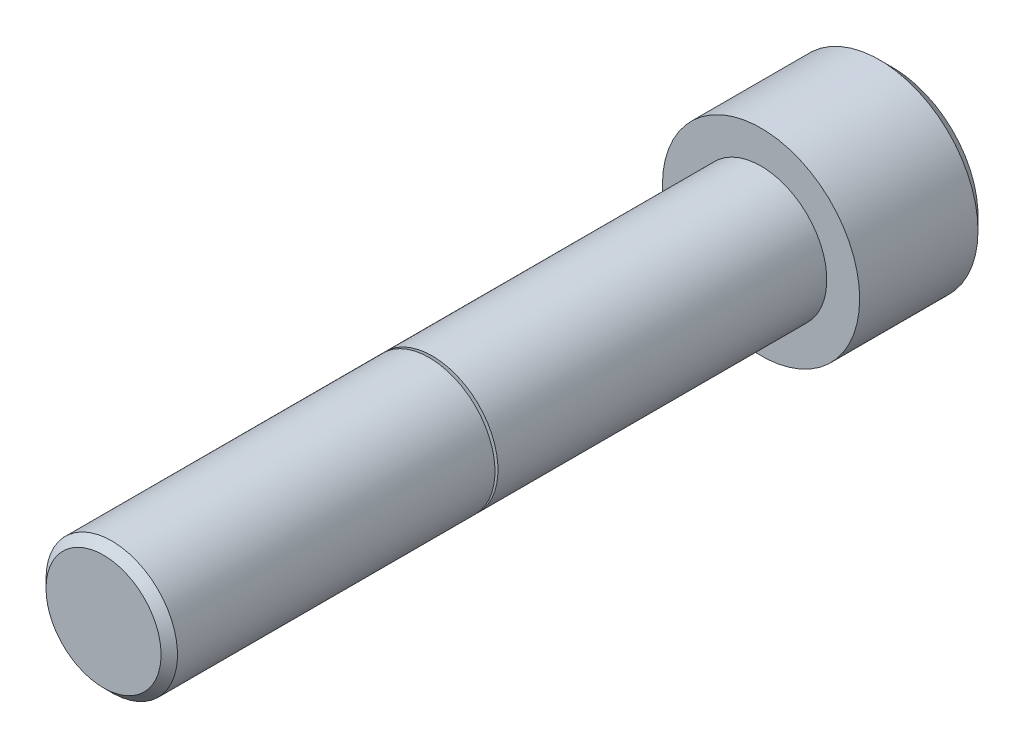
from build123d import *

# Parameters (mm, degrees)
CUT_EXTRUDE1_DEPTH = 12.7


with BuildPart() as part:
    # Logo3_bib1 → Revolve1 (revolve)
    with BuildSketch(Plane(origin=(0, 0, 0), x_dir=(-1, 0, 0), z_dir=(0, -1, 0))):
        with BuildLine():
            Line((0, -127), (0, 25.4))
            Line((0, 25.4), (16.51, 25.4))
            Line((16.51, 25.4), (19.05, 22.86))
            Line((19.05, 22.86), (19.05, 0))
            Line((19.05, 0), (12.7, 0))
            Line((12.7, 0), (12.7, -63.51))
            Line((12.7, -63.51), (11.225925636, -63.51))
            ThreePointArc((11.225925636, -63.51), (11.206229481, -63.526527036), (11.219085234, -63.548793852))
            Line((11.219085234, -63.548793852), (12.7, -64.087802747))
            Line((12.7, -64.087802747), (12.7, -125.4125))
            Line((12.7, -125.4125), (11.1125, -127))
            Line((11.1125, -127), (0, -127))
        make_face()
    revolve(axis=Axis((0, 0, -10.585154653), (0, 0, 1)))

    # Logo3_bib2 → Cut-Extrude1 (cut)
    with BuildSketch(Plane(origin=(0, 0, -25.4), x_dir=(1, 0, 0), z_dir=(0, 0, -1))):
        Polygon((10.998522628, 0), (5.499261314, 9.525), (-5.499261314, 9.525), (-10.998522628, 0), (-5.499261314, -9.525), (5.499261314, -9.525), align=None)
    extrude(amount=-CUT_EXTRUDE1_DEPTH, mode=Mode.SUBTRACT)


solid = part.part
